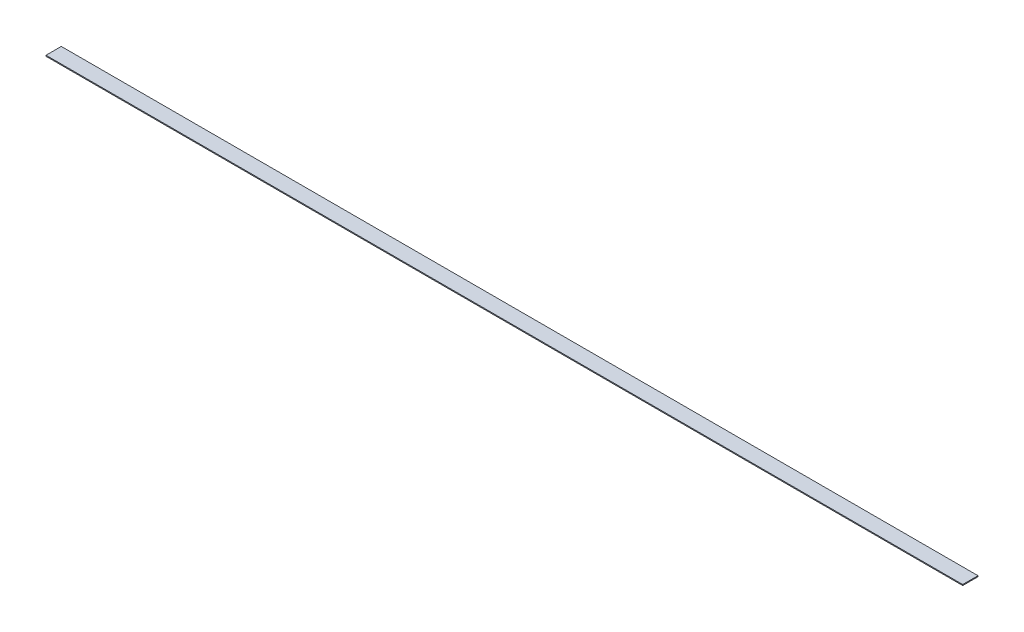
ISO-10303-21;
HEADER;
FILE_DESCRIPTION(('STEP AP214'),'2;1');
FILE_NAME('part.step','',(''),(''),'','','');
FILE_SCHEMA(('AUTOMOTIVE_DESIGN { 1 0 10303 214 1 1 1 1 }'));
ENDSEC;
DATA;
#1=APPLICATION_CONTEXT('core data for automotive mechanical design processes');
#2=APPLICATION_PROTOCOL_DEFINITION('international standard','automotive_design',2000,#1);
#3=PRODUCT_CONTEXT('',#1,'mechanical');
#4=PRODUCT('Part','Part','',(#3));
#5=PRODUCT_RELATED_PRODUCT_CATEGORY('part','',(#4));
#6=PRODUCT_DEFINITION_FORMATION('','',#4);
#7=PRODUCT_DEFINITION_CONTEXT('part definition',#1,'design');
#8=PRODUCT_DEFINITION('design','',#6,#7);
#9=PRODUCT_DEFINITION_SHAPE('','',#8);
#10=(LENGTH_UNIT() NAMED_UNIT(*) SI_UNIT(.MILLI.,.METRE.));
#11=(NAMED_UNIT(*) PLANE_ANGLE_UNIT() SI_UNIT($,.RADIAN.));
#12=(NAMED_UNIT(*) SI_UNIT($,.STERADIAN.) SOLID_ANGLE_UNIT());
#13=UNCERTAINTY_MEASURE_WITH_UNIT(LENGTH_MEASURE(1.E-05),#10,'distance_accuracy_value','');
#14=(GEOMETRIC_REPRESENTATION_CONTEXT(3) GLOBAL_UNCERTAINTY_ASSIGNED_CONTEXT((#13)) GLOBAL_UNIT_ASSIGNED_CONTEXT((#10,
#11,#12)) REPRESENTATION_CONTEXT('',''));
#15=CARTESIAN_POINT('',(0.,0.,0.));
#16=DIRECTION('',(0.,0.,1.));
#17=DIRECTION('',(1.,0.,0.));
#18=AXIS2_PLACEMENT_3D('',#15,#16,#17);
#19=CARTESIAN_POINT('',(3048.,6.35000000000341,-50.799999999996));
#20=DIRECTION('',(-1.,0.,0.));
#21=DIRECTION('',(0.,0.,1.));
#22=AXIS2_PLACEMENT_3D('',#19,#20,#21);
#23=PLANE('',#22);
#24=DIRECTION('',(0.,0.,-1.));
#25=VECTOR('',#24,1.);
#26=CARTESIAN_POINT('',(3048.,3.33066907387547E-12,-50.7999999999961));
#27=LINE('',#26,#25);
#28=CARTESIAN_POINT('',(3048.,2.77555756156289E-12,50.8000000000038));
#29=VERTEX_POINT('',#28);
#30=CARTESIAN_POINT('',(3048.,3.33066907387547E-12,-50.7999999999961));
#31=VERTEX_POINT('',#30);
#32=EDGE_CURVE('E95',#29,#31,#27,.T.);
#33=ORIENTED_EDGE('',*,*,#32,.T.);
#34=DIRECTION('',(0.,-0.999999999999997,0.));
#35=VECTOR('',#34,1.);
#36=CARTESIAN_POINT('',(3048.,6.35000000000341,-50.799999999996));
#37=LINE('',#36,#35);
#38=CARTESIAN_POINT('',(3048.,6.35000000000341,-50.799999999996));
#39=VERTEX_POINT('',#38);
#40=EDGE_CURVE('E11',#39,#31,#37,.T.);
#41=ORIENTED_EDGE('',*,*,#40,.F.);
#42=DIRECTION('',(0.,0.,-1.));
#43=VECTOR('',#42,1.);
#44=CARTESIAN_POINT('',(3048.,6.35000000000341,-50.799999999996));
#45=LINE('',#44,#43);
#46=CARTESIAN_POINT('',(3048.,6.35000000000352,50.8000000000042));
#47=VERTEX_POINT('',#46);
#48=EDGE_CURVE('E83',#47,#39,#45,.T.);
#49=ORIENTED_EDGE('',*,*,#48,.F.);
#50=DIRECTION('',(0.,-0.999999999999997,0.));
#51=VECTOR('',#50,1.);
#52=CARTESIAN_POINT('',(3048.,6.35000000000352,50.8000000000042));
#53=LINE('',#52,#51);
#54=EDGE_CURVE('E91',#47,#29,#53,.T.);
#55=ORIENTED_EDGE('',*,*,#54,.T.);
#56=EDGE_LOOP('',(#33,#41,#49,#55));
#57=FACE_BOUND('',#56,.T.);
#58=ADVANCED_FACE('F32',(#57),#23,.F.);
#59=CARTESIAN_POINT('',(-3048.,6.34999999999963,-50.8000000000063));
#60=DIRECTION('',(0.,0.,1.));
#61=DIRECTION('',(1.,0.,0.));
#62=AXIS2_PLACEMENT_3D('',#59,#60,#61);
#63=PLANE('',#62);
#64=DIRECTION('',(-1.,0.,0.));
#65=VECTOR('',#64,1.);
#66=CARTESIAN_POINT('',(-3048.,-1.88737914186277E-12,-50.8000000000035));
#67=LINE('',#66,#65);
#68=CARTESIAN_POINT('',(-3048.,-1.88737914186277E-12,-50.8000000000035));
#69=VERTEX_POINT('',#68);
#70=EDGE_CURVE('E87',#31,#69,#67,.T.);
#71=ORIENTED_EDGE('',*,*,#70,.T.);
#72=DIRECTION('',(0.,-0.999999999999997,0.));
#73=VECTOR('',#72,1.);
#74=CARTESIAN_POINT('',(-3048.,6.34999999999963,-50.8000000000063));
#75=LINE('',#74,#73);
#76=CARTESIAN_POINT('',(-3048.,6.34999999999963,-50.8000000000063));
#77=VERTEX_POINT('',#76);
#78=EDGE_CURVE('E40',#77,#69,#75,.T.);
#79=ORIENTED_EDGE('',*,*,#78,.F.);
#80=DIRECTION('',(-1.,0.,0.));
#81=VECTOR('',#80,1.);
#82=CARTESIAN_POINT('',(-3048.,6.34999999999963,-50.8000000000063));
#83=LINE('',#82,#81);
#84=EDGE_CURVE('E78',#39,#77,#83,.T.);
#85=ORIENTED_EDGE('',*,*,#84,.F.);
#86=ORIENTED_EDGE('',*,*,#40,.T.);
#87=EDGE_LOOP('',(#71,#79,#85,#86));
#88=FACE_BOUND('',#87,.T.);
#89=ADVANCED_FACE('F86',(#88),#63,.F.);
#90=CARTESIAN_POINT('',(-3048.,6.34999999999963,-50.8000000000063));
#91=DIRECTION('',(1.,0.,0.));
#92=DIRECTION('',(0.,0.,-1.));
#93=AXIS2_PLACEMENT_3D('',#90,#91,#92);
#94=PLANE('',#93);
#95=DIRECTION('',(0.,0.,1.));
#96=VECTOR('',#95,1.);
#97=CARTESIAN_POINT('',(-3048.,-1.88737914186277E-12,-50.8000000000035));
#98=LINE('',#97,#96);
#99=CARTESIAN_POINT('',(-3048.,-3.33066907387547E-13,50.799999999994));
#100=VERTEX_POINT('',#99);
#101=EDGE_CURVE('E65',#69,#100,#98,.T.);
#102=ORIENTED_EDGE('',*,*,#101,.T.);
#103=DIRECTION('',(0.,-0.999999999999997,0.));
#104=VECTOR('',#103,1.);
#105=CARTESIAN_POINT('',(-3048.,6.3499999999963,50.7999999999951));
#106=LINE('',#105,#104);
#107=CARTESIAN_POINT('',(-3048.,6.3499999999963,50.7999999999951));
#108=VERTEX_POINT('',#107);
#109=EDGE_CURVE('E88',#108,#100,#106,.T.);
#110=ORIENTED_EDGE('',*,*,#109,.F.);
#111=DIRECTION('',(0.,0.,1.));
#112=VECTOR('',#111,1.);
#113=CARTESIAN_POINT('',(-3048.,6.34999999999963,-50.8000000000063));
#114=LINE('',#113,#112);
#115=EDGE_CURVE('E81',#77,#108,#114,.T.);
#116=ORIENTED_EDGE('',*,*,#115,.F.);
#117=ORIENTED_EDGE('',*,*,#78,.T.);
#118=EDGE_LOOP('',(#102,#110,#116,#117));
#119=FACE_BOUND('',#118,.T.);
#120=ADVANCED_FACE('F89',(#119),#94,.F.);
#121=CARTESIAN_POINT('',(-3048.,6.3499999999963,50.7999999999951));
#122=DIRECTION('',(0.,0.,-1.));
#123=DIRECTION('',(-1.,0.,0.));
#124=AXIS2_PLACEMENT_3D('',#121,#122,#123);
#125=PLANE('',#124);
#126=DIRECTION('',(1.,0.,0.));
#127=VECTOR('',#126,1.);
#128=CARTESIAN_POINT('',(-3048.,-3.33066907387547E-13,50.799999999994));
#129=LINE('',#128,#127);
#130=EDGE_CURVE('E71',#100,#29,#129,.T.);
#131=ORIENTED_EDGE('',*,*,#130,.T.);
#132=ORIENTED_EDGE('',*,*,#54,.F.);
#133=DIRECTION('',(1.,0.,0.));
#134=VECTOR('',#133,1.);
#135=CARTESIAN_POINT('',(-3048.,6.3499999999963,50.7999999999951));
#136=LINE('',#135,#134);
#137=EDGE_CURVE('E48',#108,#47,#136,.T.);
#138=ORIENTED_EDGE('',*,*,#137,.F.);
#139=ORIENTED_EDGE('',*,*,#109,.T.);
#140=EDGE_LOOP('',(#131,#132,#138,#139));
#141=FACE_BOUND('',#140,.T.);
#142=ADVANCED_FACE('F102',(#141),#125,.F.);
#143=CARTESIAN_POINT('',(3048.,6.35000000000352,50.8000000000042));
#144=DIRECTION('',(0.,0.999999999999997,0.));
#145=DIRECTION('',(0.,0.,1.));
#146=AXIS2_PLACEMENT_3D('',#143,#144,#145);
#147=PLANE('',#146);
#148=ORIENTED_EDGE('',*,*,#48,.T.);
#149=ORIENTED_EDGE('',*,*,#84,.T.);
#150=ORIENTED_EDGE('',*,*,#115,.T.);
#151=ORIENTED_EDGE('',*,*,#137,.T.);
#152=EDGE_LOOP('',(#148,#149,#150,#151));
#153=FACE_BOUND('',#152,.T.);
#154=ADVANCED_FACE('F79',(#153),#147,.T.);
#155=CARTESIAN_POINT('',(3048.,2.77555756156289E-12,50.8000000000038));
#156=DIRECTION('',(0.,0.999999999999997,0.));
#157=DIRECTION('',(0.,0.,1.));
#158=AXIS2_PLACEMENT_3D('',#155,#156,#157);
#159=PLANE('',#158);
#160=ORIENTED_EDGE('',*,*,#32,.F.);
#161=ORIENTED_EDGE('',*,*,#130,.F.);
#162=ORIENTED_EDGE('',*,*,#101,.F.);
#163=ORIENTED_EDGE('',*,*,#70,.F.);
#164=EDGE_LOOP('',(#160,#161,#162,#163));
#165=FACE_BOUND('',#164,.T.);
#166=ADVANCED_FACE('F105',(#165),#159,.F.);
#167=CLOSED_SHELL('',(#58,#89,#120,#142,#154,#166));
#168=MANIFOLD_SOLID_BREP('B2',#167);
#169=ADVANCED_BREP_SHAPE_REPRESENTATION('',(#18,#168),#14);
#170=SHAPE_DEFINITION_REPRESENTATION(#9,#169);
ENDSEC;
END-ISO-10303-21;
